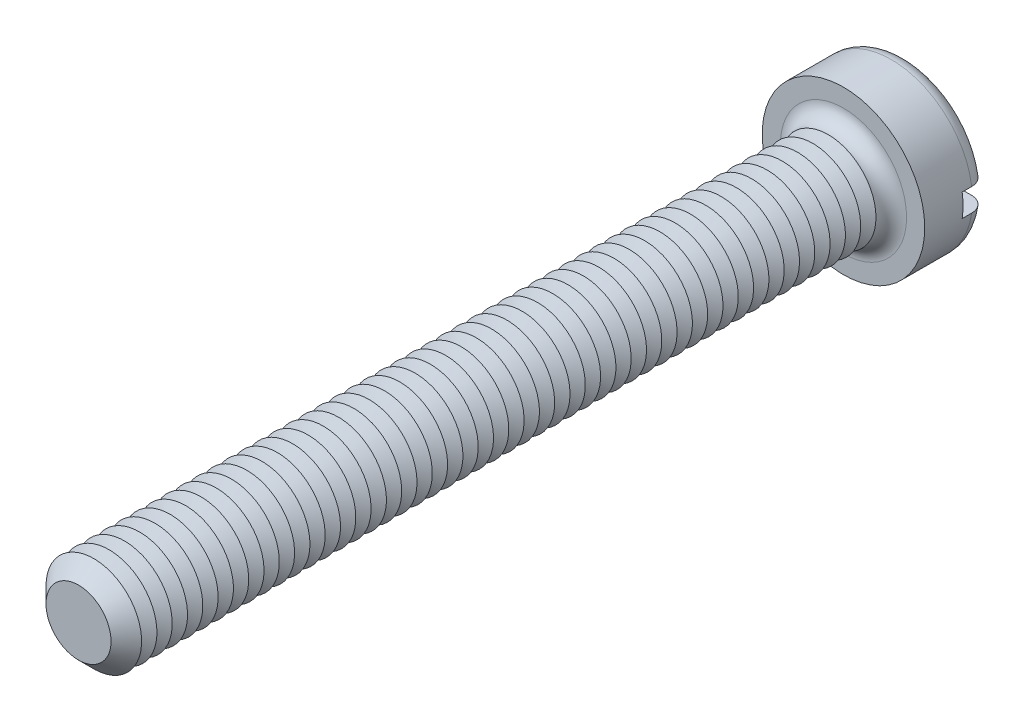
from build123d import *

# Parameters (mm, degrees)
SKETCH3_R           = 4.25
BOSS_EXTRUDE2_DEPTH = 3.3
SKETCH4_R           = 2.5
BOSS_EXTRUDE3_DEPTH = 40
FILLET1_R           = 0.8
CHAMFER1_SIZE       = 0.8
LPATTERN1_COUNT     = 48
LPATTERN1_PITCH     = 0.8
SKETCH8_W           = 8.5
SKETCH8_H           = 1.2
CUT_EXTRUDE1_DEPTH  = 1.3


with BuildPart() as part:
    # Sketch3 → Boss-Extrude2 (new body)
    with BuildSketch(Plane.XY):
        Circle(SKETCH3_R)
    extrude(amount=-BOSS_EXTRUDE2_DEPTH)

    # Sketch4 → Boss-Extrude3 (add)
    with BuildSketch(Plane.XY):
        Circle(SKETCH4_R)
    extrude(amount=BOSS_EXTRUDE3_DEPTH)

    # Fillet1
    fillet1_edges = [part.edges().sort_by_distance(p)[0] for p in [
        (-4.25, 0, -3.3),
        (-2.5, 0, 0),
    ]]
    fillet(fillet1_edges, radius=FILLET1_R)

    # Chamfer1
    chamfer1_edges = [part.edges().sort_by_distance(p)[0] for p in [
        (-2.5, 0, 40),
    ]]
    chamfer(chamfer1_edges, length=CHAMFER1_SIZE)

    # Sketch6 → Cut-Revolve1 (revolve, cut)
    with BuildSketch(Plane(origin=(0, 0, 0), x_dir=(0, 0, -1), z_dir=(1, 0, 0)), mode=Mode.PRIVATE) as cut_revolve1_sk:
        Polygon((-0.8, 2.5), (-1.2, 1.807179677), (-1.6, 2.5), align=None)
    cut_revolve1 = revolve(cut_revolve1_sk.sketch.rotate(Axis((0, 0, -1.694361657), (0, 0, 1)), 90), axis=Axis((0, 0, -1.694361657), (0, 0, 1)), mode=Mode.SUBTRACT)

    # LPattern1: Cut-Revolve1 ×48
    with Locations(*[(0, 0, i * LPATTERN1_PITCH) for i in range(1, LPATTERN1_COUNT)]):
        add(cut_revolve1, mode=Mode.SUBTRACT)

    # Sketch8 → Cut-Extrude1 (cut)
    with BuildSketch(Plane(origin=(0, 0, -3.3), x_dir=(-1, 0, 0), z_dir=(0, 0, -1))):
        Rectangle(SKETCH8_W, SKETCH8_H)
    extrude(amount=-CUT_EXTRUDE1_DEPTH, mode=Mode.SUBTRACT)


solid = part.part
